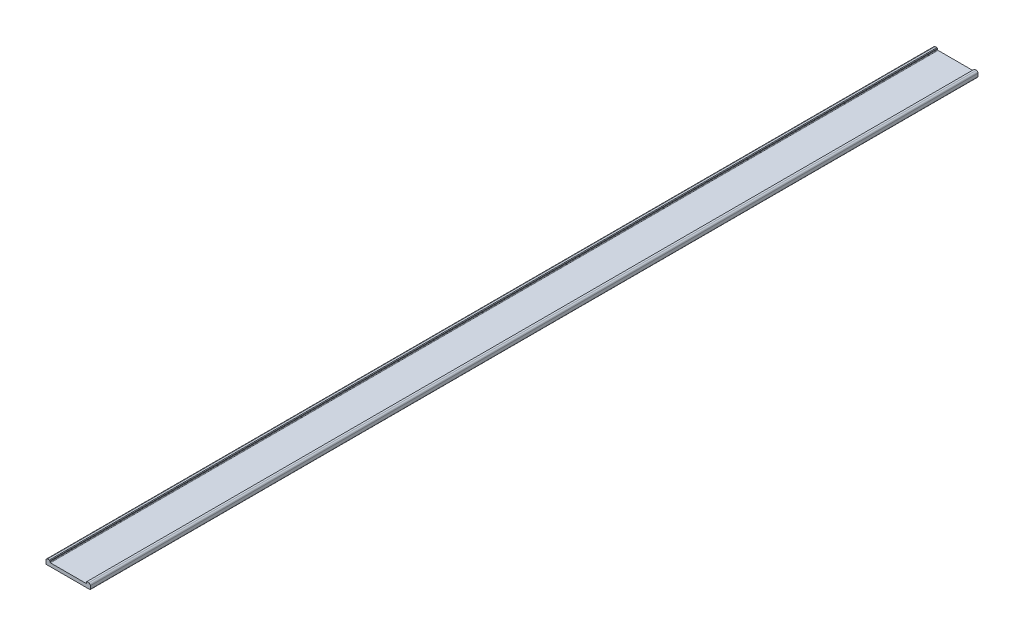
from build123d import *

# Parameters (mm, degrees)
BOSS_EXTRUDE1_DEPTH = 800


with BuildPart() as part:
    # Sketch1 → Boss-Extrude1 (new body)
    with BuildSketch(Plane.XY):
        with BuildLine():
            Line((36.75, 4.8), (38.5, 4.8))
            ThreePointArc((38.5, 4.8), (39.560660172, 4.360660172), (40, 3.3))
            Line((40, 3.3), (40, 0.5))
            ThreePointArc((40, 0.5), (39.853553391, 0.146446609), (39.5, 0))
            Line((39.5, 0), (0.5, 0))
            ThreePointArc((0.5, 0), (0.146446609, 0.146446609), (0, 0.5))
            Line((0, 0.5), (0, 3.3))
            ThreePointArc((0, 3.3), (0.439339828, 4.360660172), (1.5, 4.8))
            Line((1.5, 4.8), (3, 4.8))
            Line((3, 4.8), (3.5, 4.3))
            Line((3.5, 4.3), (3.5, 3.6))
            ThreePointArc((3.5, 3.6), (3.646446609, 3.246446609), (4, 3.1))
            Line((4, 3.1), (36, 3.1))
            ThreePointArc((36, 3.1), (36.353553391, 3.246446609), (36.5, 3.6))
            Line((36.5, 3.6), (36.5, 4.55))
            Line((36.5, 4.55), (36.75, 4.8))
        make_face()
    extrude(amount=-BOSS_EXTRUDE1_DEPTH)


solid = part.part
